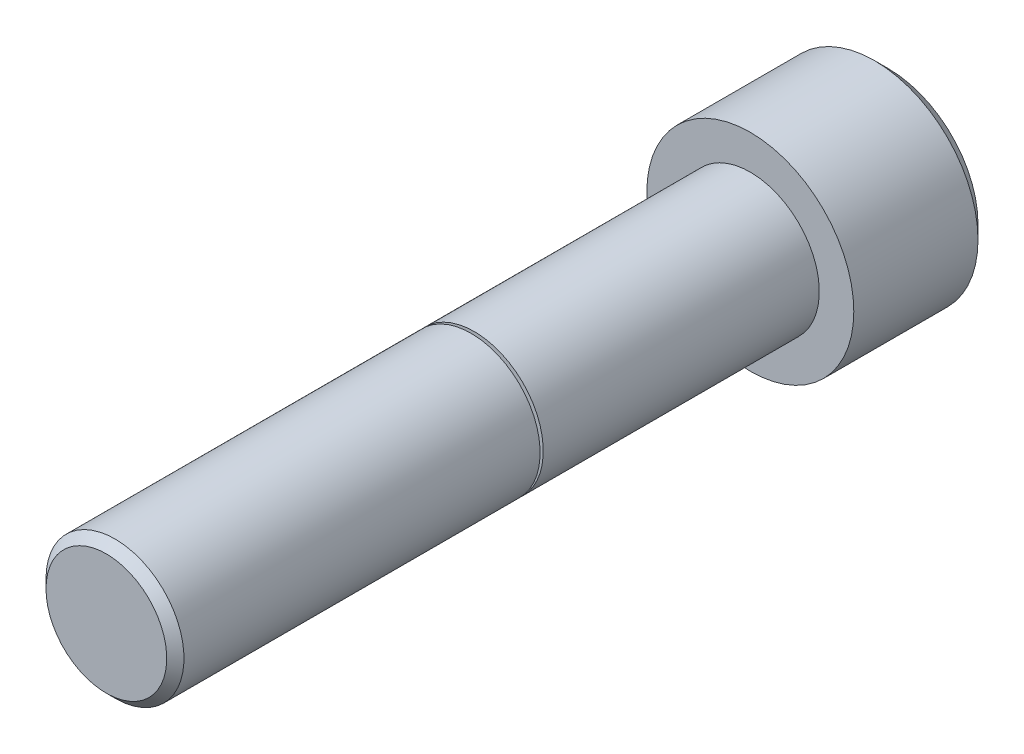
ISO-10303-21;
HEADER;
FILE_DESCRIPTION(('STEP AP214'),'2;1');
FILE_NAME('part.step','',(''),(''),'','','');
FILE_SCHEMA(('AUTOMOTIVE_DESIGN { 1 0 10303 214 1 1 1 1 }'));
ENDSEC;
DATA;
#1=APPLICATION_CONTEXT('core data for automotive mechanical design processes');
#2=APPLICATION_PROTOCOL_DEFINITION('international standard','automotive_design',2000,#1);
#3=PRODUCT_CONTEXT('',#1,'mechanical');
#4=PRODUCT('Part','Part','',(#3));
#5=PRODUCT_RELATED_PRODUCT_CATEGORY('part','',(#4));
#6=PRODUCT_DEFINITION_FORMATION('','',#4);
#7=PRODUCT_DEFINITION_CONTEXT('part definition',#1,'design');
#8=PRODUCT_DEFINITION('design','',#6,#7);
#9=PRODUCT_DEFINITION_SHAPE('','',#8);
#10=(LENGTH_UNIT() NAMED_UNIT(*) SI_UNIT(.MILLI.,.METRE.));
#11=(NAMED_UNIT(*) PLANE_ANGLE_UNIT() SI_UNIT($,.RADIAN.));
#12=(NAMED_UNIT(*) SI_UNIT($,.STERADIAN.) SOLID_ANGLE_UNIT());
#13=UNCERTAINTY_MEASURE_WITH_UNIT(LENGTH_MEASURE(1.E-05),#10,'distance_accuracy_value','');
#14=(GEOMETRIC_REPRESENTATION_CONTEXT(3) GLOBAL_UNCERTAINTY_ASSIGNED_CONTEXT((#13)) GLOBAL_UNIT_ASSIGNED_CONTEXT((#10,
#11,#12)) REPRESENTATION_CONTEXT('',''));
#15=CARTESIAN_POINT('',(0.,0.,0.));
#16=DIRECTION('',(0.,0.,1.));
#17=DIRECTION('',(1.,0.,0.));
#18=AXIS2_PLACEMENT_3D('',#15,#16,#17);
#19=CARTESIAN_POINT('',(0.,0.,-19.05));
#20=DIRECTION('',(0.,0.,1.));
#21=DIRECTION('',(1.,0.,0.));
#22=AXIS2_PLACEMENT_3D('',#19,#20,#21);
#23=PLANE('',#22);
#24=DIRECTION('',(-0.5,-0.866025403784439,0.));
#25=VECTOR('',#24,1.);
#26=CARTESIAN_POINT('',(9.16543552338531,0.,-19.05));
#27=LINE('',#26,#25);
#28=CARTESIAN_POINT('',(9.16543552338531,0.,-19.05));
#29=VERTEX_POINT('',#28);
#30=CARTESIAN_POINT('',(4.58271776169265,-7.9375,-19.05));
#31=VERTEX_POINT('',#30);
#32=EDGE_CURVE('E147',#29,#31,#27,.T.);
#33=ORIENTED_EDGE('',*,*,#32,.F.);
#34=DIRECTION('',(0.5,-0.866025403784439,0.));
#35=VECTOR('',#34,1.);
#36=CARTESIAN_POINT('',(4.58271776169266,7.9375,-19.05));
#37=LINE('',#36,#35);
#38=CARTESIAN_POINT('',(4.58271776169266,7.9375,-19.05));
#39=VERTEX_POINT('',#38);
#40=EDGE_CURVE('E66',#39,#29,#37,.T.);
#41=ORIENTED_EDGE('',*,*,#40,.F.);
#42=DIRECTION('',(1.,0.,0.));
#43=VECTOR('',#42,1.);
#44=CARTESIAN_POINT('',(-4.58271776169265,7.9375,-19.05));
#45=LINE('',#44,#43);
#46=CARTESIAN_POINT('',(-4.58271776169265,7.9375,-19.05));
#47=VERTEX_POINT('',#46);
#48=EDGE_CURVE('E160',#47,#39,#45,.T.);
#49=ORIENTED_EDGE('',*,*,#48,.F.);
#50=DIRECTION('',(0.5,0.866025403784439,0.));
#51=VECTOR('',#50,1.);
#52=CARTESIAN_POINT('',(-9.16543552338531,0.,-19.05));
#53=LINE('',#52,#51);
#54=CARTESIAN_POINT('',(-9.16543552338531,0.,-19.05));
#55=VERTEX_POINT('',#54);
#56=EDGE_CURVE('E157',#55,#47,#53,.T.);
#57=ORIENTED_EDGE('',*,*,#56,.F.);
#58=DIRECTION('',(-0.5,0.866025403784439,0.));
#59=VECTOR('',#58,1.);
#60=CARTESIAN_POINT('',(-4.58271776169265,-7.9375,-19.05));
#61=LINE('',#60,#59);
#62=CARTESIAN_POINT('',(-4.58271776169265,-7.9375,-19.05));
#63=VERTEX_POINT('',#62);
#64=EDGE_CURVE('E114',#63,#55,#61,.T.);
#65=ORIENTED_EDGE('',*,*,#64,.F.);
#66=DIRECTION('',(-1.,0.,0.));
#67=VECTOR('',#66,1.);
#68=CARTESIAN_POINT('',(4.58271776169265,-7.9375,-19.05));
#69=LINE('',#68,#67);
#70=EDGE_CURVE('E151',#31,#63,#69,.T.);
#71=ORIENTED_EDGE('',*,*,#70,.F.);
#72=EDGE_LOOP('',(#33,#41,#49,#57,#65,#71));
#73=FACE_BOUND('',#72,.T.);
#74=CARTESIAN_POINT('',(0.,0.,-19.05));
#75=DIRECTION('',(0.,0.,-1.));
#76=DIRECTION('',(-1.,0.,0.));
#77=AXIS2_PLACEMENT_3D('',#74,#75,#76);
#78=CIRCLE('',#77,12.3825);
#79=CARTESIAN_POINT('',(-12.3825,0.,-19.05));
#80=VERTEX_POINT('',#79);
#81=EDGE_CURVE('E166',#80,#80,#78,.T.);
#82=ORIENTED_EDGE('',*,*,#81,.T.);
#83=EDGE_LOOP('',(#82));
#84=FACE_BOUND('',#83,.T.);
#85=ADVANCED_FACE('F51',(#73,#84),#23,.F.);
#86=CARTESIAN_POINT('',(-8.33374000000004,0.,88.9));
#87=DIRECTION('',(0.,0.,-1.));
#88=DIRECTION('',(-1.,0.,0.));
#89=AXIS2_PLACEMENT_3D('',#86,#87,#88);
#90=PLANE('',#89);
#91=CARTESIAN_POINT('',(0.,0.,88.9));
#92=DIRECTION('',(0.,0.,-1.));
#93=DIRECTION('',(-1.,0.,0.));
#94=AXIS2_PLACEMENT_3D('',#91,#92,#93);
#95=CIRCLE('',#94,8.33374000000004);
#96=CARTESIAN_POINT('',(-8.33374000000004,0.,88.9));
#97=VERTEX_POINT('',#96);
#98=EDGE_CURVE('E11',#97,#97,#95,.T.);
#99=ORIENTED_EDGE('',*,*,#98,.F.);
#100=EDGE_LOOP('',(#99));
#101=FACE_BOUND('',#100,.T.);
#102=ADVANCED_FACE('F216',(#101),#90,.F.);
#103=CARTESIAN_POINT('',(0.,0.,88.9));
#104=DIRECTION('',(0.,0.,-1.));
#105=DIRECTION('',(-1.,0.,0.));
#106=AXIS2_PLACEMENT_3D('',#103,#104,#105);
#107=CONICAL_SURFACE('',#106,8.33374000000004,0.785398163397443);
#108=CARTESIAN_POINT('',(0.,0.,87.70874));
#109=DIRECTION('',(0.,0.,-1.));
#110=DIRECTION('',(-1.,0.,0.));
#111=AXIS2_PLACEMENT_3D('',#108,#109,#110);
#112=CIRCLE('',#111,9.52500000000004);
#113=CARTESIAN_POINT('',(-9.52500000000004,0.,87.70874));
#114=VERTEX_POINT('',#113);
#115=EDGE_CURVE('E59',#114,#114,#112,.T.);
#116=ORIENTED_EDGE('',*,*,#115,.F.);
#117=EDGE_LOOP('',(#116));
#118=FACE_BOUND('',#117,.T.);
#119=ORIENTED_EDGE('',*,*,#98,.T.);
#120=EDGE_LOOP('',(#119));
#121=FACE_BOUND('',#120,.T.);
#122=ADVANCED_FACE('F213',(#118,#121),#107,.T.);
#123=CARTESIAN_POINT('',(0.,0.,-10.585154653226));
#124=DIRECTION('',(0.,0.,-1.));
#125=DIRECTION('',(-1.,0.,0.));
#126=AXIS2_PLACEMENT_3D('',#123,#124,#125);
#127=CYLINDRICAL_SURFACE('',#126,9.52500000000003);
#128=CARTESIAN_POINT('',(0.,0.,38.5435831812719));
#129=DIRECTION('',(0.,0.,-1.));
#130=DIRECTION('',(-1.,0.,0.));
#131=AXIS2_PLACEMENT_3D('',#128,#129,#130);
#132=CIRCLE('',#131,9.52500000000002);
#133=CARTESIAN_POINT('',(-9.52500000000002,0.,38.5435831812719));
#134=VERTEX_POINT('',#133);
#135=EDGE_CURVE('E203',#134,#134,#132,.T.);
#136=ORIENTED_EDGE('',*,*,#135,.F.);
#137=EDGE_LOOP('',(#136));
#138=FACE_BOUND('',#137,.T.);
#139=ORIENTED_EDGE('',*,*,#115,.T.);
#140=EDGE_LOOP('',(#139));
#141=FACE_BOUND('',#140,.T.);
#142=ADVANCED_FACE('F211',(#138,#141),#127,.T.);
#143=CARTESIAN_POINT('',(0.,0.,38.5435831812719));
#144=DIRECTION('',(0.,0.,1.));
#145=DIRECTION('',(1.,0.,0.));
#146=AXIS2_PLACEMENT_3D('',#143,#144,#145);
#147=CONICAL_SURFACE('',#146,9.52500000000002,1.22173047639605);
#148=CARTESIAN_POINT('',(0.,0.,38.1487938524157));
#149=DIRECTION('',(0.,0.,-1.));
#150=DIRECTION('',(-1.,0.,0.));
#151=AXIS2_PLACEMENT_3D('',#148,#149,#150);
#152=CIRCLE('',#151,8.44032523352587);
#153=CARTESIAN_POINT('',(-8.44032523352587,0.,38.1487938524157));
#154=VERTEX_POINT('',#153);
#155=EDGE_CURVE('E199',#154,#154,#152,.T.);
#156=ORIENTED_EDGE('',*,*,#155,.F.);
#157=EDGE_LOOP('',(#156));
#158=FACE_BOUND('',#157,.T.);
#159=ORIENTED_EDGE('',*,*,#135,.T.);
#160=EDGE_LOOP('',(#159));
#161=FACE_BOUND('',#160,.T.);
#162=ADVANCED_FACE('F228',(#158,#161),#147,.T.);
#163=CARTESIAN_POINT('',(0.,0.,38.13));
#164=DIRECTION('',(0.,0.,-1.));
#165=DIRECTION('',(-1.,0.,0.));
#166=AXIS2_PLACEMENT_3D('',#163,#164,#165);
#167=TOROIDAL_SURFACE('',#166,8.44716563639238,0.0200000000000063);
#168=CARTESIAN_POINT('',(0.,0.,38.11));
#169=DIRECTION('',(0.,0.,-1.));
#170=DIRECTION('',(-1.,0.,0.));
#171=AXIS2_PLACEMENT_3D('',#168,#169,#170);
#172=CIRCLE('',#171,8.44716563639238);
#173=CARTESIAN_POINT('',(-8.44716563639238,0.,38.11));
#174=VERTEX_POINT('',#173);
#175=EDGE_CURVE('E195',#174,#174,#172,.T.);
#176=ORIENTED_EDGE('',*,*,#175,.F.);
#177=EDGE_LOOP('',(#176));
#178=FACE_BOUND('',#177,.T.);
#179=ORIENTED_EDGE('',*,*,#155,.T.);
#180=EDGE_LOOP('',(#179));
#181=FACE_BOUND('',#180,.T.);
#182=ADVANCED_FACE('F232',(#178,#181),#167,.F.);
#183=CARTESIAN_POINT('',(-9.52500000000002,0.,38.11));
#184=DIRECTION('',(0.,0.,-1.));
#185=DIRECTION('',(-1.,0.,0.));
#186=AXIS2_PLACEMENT_3D('',#183,#184,#185);
#187=PLANE('',#186);
#188=CARTESIAN_POINT('',(0.,0.,38.11));
#189=DIRECTION('',(0.,0.,-1.));
#190=DIRECTION('',(-1.,0.,0.));
#191=AXIS2_PLACEMENT_3D('',#188,#189,#190);
#192=CIRCLE('',#191,9.52500000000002);
#193=CARTESIAN_POINT('',(-9.52500000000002,0.,38.11));
#194=VERTEX_POINT('',#193);
#195=EDGE_CURVE('E191',#194,#194,#192,.T.);
#196=ORIENTED_EDGE('',*,*,#195,.F.);
#197=EDGE_LOOP('',(#196));
#198=FACE_BOUND('',#197,.T.);
#199=ORIENTED_EDGE('',*,*,#175,.T.);
#200=EDGE_LOOP('',(#199));
#201=FACE_BOUND('',#200,.T.);
#202=ADVANCED_FACE('F236',(#198,#201),#187,.F.);
#203=CARTESIAN_POINT('',(0.,0.,-10.585154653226));
#204=DIRECTION('',(0.,0.,-1.));
#205=DIRECTION('',(-1.,0.,0.));
#206=AXIS2_PLACEMENT_3D('',#203,#204,#205);
#207=CYLINDRICAL_SURFACE('',#206,9.52500000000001);
#208=CARTESIAN_POINT('',(0.,0.,0.));
#209=DIRECTION('',(0.,0.,-1.));
#210=DIRECTION('',(-1.,0.,0.));
#211=AXIS2_PLACEMENT_3D('',#208,#209,#210);
#212=CIRCLE('',#211,9.525);
#213=CARTESIAN_POINT('',(-9.525,0.,0.));
#214=VERTEX_POINT('',#213);
#215=EDGE_CURVE('E187',#214,#214,#212,.T.);
#216=ORIENTED_EDGE('',*,*,#215,.F.);
#217=EDGE_LOOP('',(#216));
#218=FACE_BOUND('',#217,.T.);
#219=ORIENTED_EDGE('',*,*,#195,.T.);
#220=EDGE_LOOP('',(#219));
#221=FACE_BOUND('',#220,.T.);
#222=ADVANCED_FACE('F240',(#218,#221),#207,.T.);
#223=CARTESIAN_POINT('',(-14.2875,0.,0.));
#224=DIRECTION('',(0.,0.,-1.));
#225=DIRECTION('',(-1.,0.,0.));
#226=AXIS2_PLACEMENT_3D('',#223,#224,#225);
#227=PLANE('',#226);
#228=CARTESIAN_POINT('',(0.,0.,0.));
#229=DIRECTION('',(0.,0.,-1.));
#230=DIRECTION('',(-1.,0.,0.));
#231=AXIS2_PLACEMENT_3D('',#228,#229,#230);
#232=CIRCLE('',#231,14.2875);
#233=CARTESIAN_POINT('',(-14.2875,0.,0.));
#234=VERTEX_POINT('',#233);
#235=EDGE_CURVE('E183',#234,#234,#232,.T.);
#236=ORIENTED_EDGE('',*,*,#235,.F.);
#237=EDGE_LOOP('',(#236));
#238=FACE_BOUND('',#237,.T.);
#239=ORIENTED_EDGE('',*,*,#215,.T.);
#240=EDGE_LOOP('',(#239));
#241=FACE_BOUND('',#240,.T.);
#242=ADVANCED_FACE('F244',(#238,#241),#227,.F.);
#243=CARTESIAN_POINT('',(0.,0.,-10.585154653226));
#244=DIRECTION('',(0.,0.,-1.));
#245=DIRECTION('',(-1.,0.,0.));
#246=AXIS2_PLACEMENT_3D('',#243,#244,#245);
#247=CYLINDRICAL_SURFACE('',#246,14.2875);
#248=CARTESIAN_POINT('',(0.,0.,-17.145));
#249=DIRECTION('',(0.,0.,-1.));
#250=DIRECTION('',(-1.,0.,0.));
#251=AXIS2_PLACEMENT_3D('',#248,#249,#250);
#252=CIRCLE('',#251,14.2875);
#253=CARTESIAN_POINT('',(-14.2875,0.,-17.145));
#254=VERTEX_POINT('',#253);
#255=EDGE_CURVE('E179',#254,#254,#252,.T.);
#256=ORIENTED_EDGE('',*,*,#255,.F.);
#257=EDGE_LOOP('',(#256));
#258=FACE_BOUND('',#257,.T.);
#259=ORIENTED_EDGE('',*,*,#235,.T.);
#260=EDGE_LOOP('',(#259));
#261=FACE_BOUND('',#260,.T.);
#262=ADVANCED_FACE('F248',(#258,#261),#247,.T.);
#263=CARTESIAN_POINT('',(0.,0.,-17.145));
#264=DIRECTION('',(0.,0.,1.));
#265=DIRECTION('',(1.,0.,0.));
#266=AXIS2_PLACEMENT_3D('',#263,#264,#265);
#267=CONICAL_SURFACE('',#266,14.2875,0.785398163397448);
#268=ORIENTED_EDGE('',*,*,#81,.F.);
#269=EDGE_LOOP('',(#268));
#270=FACE_BOUND('',#269,.T.);
#271=ORIENTED_EDGE('',*,*,#255,.T.);
#272=EDGE_LOOP('',(#271));
#273=FACE_BOUND('',#272,.T.);
#274=ADVANCED_FACE('F252',(#270,#273),#267,.T.);
#275=CARTESIAN_POINT('',(4.58271776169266,7.9375,-9.525));
#276=DIRECTION('',(0.866025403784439,0.5,0.));
#277=DIRECTION('',(-0.5,0.866025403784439,0.));
#278=AXIS2_PLACEMENT_3D('',#275,#276,#277);
#279=PLANE('',#278);
#280=ORIENTED_EDGE('',*,*,#40,.T.);
#281=DIRECTION('',(0.,0.,-1.));
#282=VECTOR('',#281,1.);
#283=CARTESIAN_POINT('',(9.16543552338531,0.,-9.525));
#284=LINE('',#283,#282);
#285=CARTESIAN_POINT('',(9.16543552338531,0.,-9.525));
#286=VERTEX_POINT('',#285);
#287=EDGE_CURVE('E96',#286,#29,#284,.T.);
#288=ORIENTED_EDGE('',*,*,#287,.F.);
#289=DIRECTION('',(0.5,-0.866025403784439,0.));
#290=VECTOR('',#289,1.);
#291=CARTESIAN_POINT('',(4.58271776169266,7.9375,-9.525));
#292=LINE('',#291,#290);
#293=CARTESIAN_POINT('',(4.58271776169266,7.9375,-9.525));
#294=VERTEX_POINT('',#293);
#295=EDGE_CURVE('E163',#294,#286,#292,.T.);
#296=ORIENTED_EDGE('',*,*,#295,.F.);
#297=DIRECTION('',(0.,0.,-1.));
#298=VECTOR('',#297,1.);
#299=CARTESIAN_POINT('',(4.58271776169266,7.9375,-9.525));
#300=LINE('',#299,#298);
#301=EDGE_CURVE('E74',#294,#39,#300,.T.);
#302=ORIENTED_EDGE('',*,*,#301,.T.);
#303=EDGE_LOOP('',(#280,#288,#296,#302));
#304=FACE_BOUND('',#303,.T.);
#305=ADVANCED_FACE('F256',(#304),#279,.F.);
#306=CARTESIAN_POINT('',(-4.58271776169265,7.9375,-9.525));
#307=DIRECTION('',(0.,1.,0.));
#308=DIRECTION('',(-1.,0.,0.));
#309=AXIS2_PLACEMENT_3D('',#306,#307,#308);
#310=PLANE('',#309);
#311=ORIENTED_EDGE('',*,*,#48,.T.);
#312=ORIENTED_EDGE('',*,*,#301,.F.);
#313=DIRECTION('',(1.,0.,0.));
#314=VECTOR('',#313,1.);
#315=CARTESIAN_POINT('',(-4.58271776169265,7.9375,-9.525));
#316=LINE('',#315,#314);
#317=CARTESIAN_POINT('',(-4.58271776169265,7.9375,-9.525));
#318=VERTEX_POINT('',#317);
#319=EDGE_CURVE('E128',#318,#294,#316,.T.);
#320=ORIENTED_EDGE('',*,*,#319,.F.);
#321=DIRECTION('',(0.,0.,-1.));
#322=VECTOR('',#321,1.);
#323=CARTESIAN_POINT('',(-4.58271776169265,7.9375,-9.525));
#324=LINE('',#323,#322);
#325=EDGE_CURVE('E119',#318,#47,#324,.T.);
#326=ORIENTED_EDGE('',*,*,#325,.T.);
#327=EDGE_LOOP('',(#311,#312,#320,#326));
#328=FACE_BOUND('',#327,.T.);
#329=ADVANCED_FACE('F260',(#328),#310,.F.);
#330=CARTESIAN_POINT('',(-9.16543552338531,0.,-9.525));
#331=DIRECTION('',(-0.866025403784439,0.5,0.));
#332=DIRECTION('',(-0.5,-0.866025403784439,0.));
#333=AXIS2_PLACEMENT_3D('',#330,#331,#332);
#334=PLANE('',#333);
#335=ORIENTED_EDGE('',*,*,#56,.T.);
#336=ORIENTED_EDGE('',*,*,#325,.F.);
#337=DIRECTION('',(0.5,0.866025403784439,0.));
#338=VECTOR('',#337,1.);
#339=CARTESIAN_POINT('',(-9.16543552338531,0.,-9.525));
#340=LINE('',#339,#338);
#341=CARTESIAN_POINT('',(-9.16543552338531,0.,-9.525));
#342=VERTEX_POINT('',#341);
#343=EDGE_CURVE('E123',#342,#318,#340,.T.);
#344=ORIENTED_EDGE('',*,*,#343,.F.);
#345=DIRECTION('',(0.,0.,-1.));
#346=VECTOR('',#345,1.);
#347=CARTESIAN_POINT('',(-9.16543552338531,0.,-9.525));
#348=LINE('',#347,#346);
#349=EDGE_CURVE('E107',#342,#55,#348,.T.);
#350=ORIENTED_EDGE('',*,*,#349,.T.);
#351=EDGE_LOOP('',(#335,#336,#344,#350));
#352=FACE_BOUND('',#351,.T.);
#353=ADVANCED_FACE('F124',(#352),#334,.F.);
#354=CARTESIAN_POINT('',(-4.58271776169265,-7.9375,-9.525));
#355=DIRECTION('',(-0.866025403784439,-0.5,0.));
#356=DIRECTION('',(0.5,-0.866025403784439,0.));
#357=AXIS2_PLACEMENT_3D('',#354,#355,#356);
#358=PLANE('',#357);
#359=ORIENTED_EDGE('',*,*,#64,.T.);
#360=ORIENTED_EDGE('',*,*,#349,.F.);
#361=DIRECTION('',(-0.5,0.866025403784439,0.));
#362=VECTOR('',#361,1.);
#363=CARTESIAN_POINT('',(-4.58271776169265,-7.9375,-9.525));
#364=LINE('',#363,#362);
#365=CARTESIAN_POINT('',(-4.58271776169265,-7.9375,-9.525));
#366=VERTEX_POINT('',#365);
#367=EDGE_CURVE('E111',#366,#342,#364,.T.);
#368=ORIENTED_EDGE('',*,*,#367,.F.);
#369=DIRECTION('',(0.,0.,-1.));
#370=VECTOR('',#369,1.);
#371=CARTESIAN_POINT('',(-4.58271776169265,-7.9375,-9.525));
#372=LINE('',#371,#370);
#373=EDGE_CURVE('E120',#366,#63,#372,.T.);
#374=ORIENTED_EDGE('',*,*,#373,.T.);
#375=EDGE_LOOP('',(#359,#360,#368,#374));
#376=FACE_BOUND('',#375,.T.);
#377=ADVANCED_FACE('F109',(#376),#358,.F.);
#378=CARTESIAN_POINT('',(4.58271776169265,-7.9375,-9.525));
#379=DIRECTION('',(0.,-1.,0.));
#380=DIRECTION('',(0.,0.,-1.));
#381=AXIS2_PLACEMENT_3D('',#378,#379,#380);
#382=PLANE('',#381);
#383=ORIENTED_EDGE('',*,*,#70,.T.);
#384=ORIENTED_EDGE('',*,*,#373,.F.);
#385=DIRECTION('',(-1.,0.,0.));
#386=VECTOR('',#385,1.);
#387=CARTESIAN_POINT('',(4.58271776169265,-7.9375,-9.525));
#388=LINE('',#387,#386);
#389=CARTESIAN_POINT('',(4.58271776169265,-7.9375,-9.525));
#390=VERTEX_POINT('',#389);
#391=EDGE_CURVE('E134',#390,#366,#388,.T.);
#392=ORIENTED_EDGE('',*,*,#391,.F.);
#393=DIRECTION('',(0.,0.,-1.));
#394=VECTOR('',#393,1.);
#395=CARTESIAN_POINT('',(4.58271776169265,-7.9375,-9.525));
#396=LINE('',#395,#394);
#397=EDGE_CURVE('E171',#390,#31,#396,.T.);
#398=ORIENTED_EDGE('',*,*,#397,.T.);
#399=EDGE_LOOP('',(#383,#384,#392,#398));
#400=FACE_BOUND('',#399,.T.);
#401=ADVANCED_FACE('F264',(#400),#382,.F.);
#402=CARTESIAN_POINT('',(9.16543552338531,0.,-9.525));
#403=DIRECTION('',(0.866025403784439,-0.5,0.));
#404=DIRECTION('',(0.5,0.866025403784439,0.));
#405=AXIS2_PLACEMENT_3D('',#402,#403,#404);
#406=PLANE('',#405);
#407=ORIENTED_EDGE('',*,*,#32,.T.);
#408=ORIENTED_EDGE('',*,*,#397,.F.);
#409=DIRECTION('',(-0.5,-0.866025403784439,0.));
#410=VECTOR('',#409,1.);
#411=CARTESIAN_POINT('',(9.16543552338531,0.,-9.525));
#412=LINE('',#411,#410);
#413=EDGE_CURVE('E139',#286,#390,#412,.T.);
#414=ORIENTED_EDGE('',*,*,#413,.F.);
#415=ORIENTED_EDGE('',*,*,#287,.T.);
#416=EDGE_LOOP('',(#407,#408,#414,#415));
#417=FACE_BOUND('',#416,.T.);
#418=ADVANCED_FACE('F261',(#417),#406,.F.);
#419=CARTESIAN_POINT('',(4.58271776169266,7.9375,-9.525));
#420=DIRECTION('',(0.,0.,1.));
#421=DIRECTION('',(1.,0.,0.));
#422=AXIS2_PLACEMENT_3D('',#419,#420,#421);
#423=PLANE('',#422);
#424=ORIENTED_EDGE('',*,*,#295,.T.);
#425=ORIENTED_EDGE('',*,*,#413,.T.);
#426=ORIENTED_EDGE('',*,*,#391,.T.);
#427=ORIENTED_EDGE('',*,*,#367,.T.);
#428=ORIENTED_EDGE('',*,*,#343,.T.);
#429=ORIENTED_EDGE('',*,*,#319,.T.);
#430=EDGE_LOOP('',(#424,#425,#426,#427,#428,#429));
#431=FACE_BOUND('',#430,.T.);
#432=ADVANCED_FACE('F131',(#431),#423,.F.);
#433=CLOSED_SHELL('',(#85,#102,#122,#142,#162,#182,#202,#222,#242,#262,#274,#305,#329,#353,#377,
#401,#418,#432));
#434=MANIFOLD_SOLID_BREP('B2',#433);
#435=ADVANCED_BREP_SHAPE_REPRESENTATION('',(#18,#434),#14);
#436=SHAPE_DEFINITION_REPRESENTATION(#9,#435);
ENDSEC;
END-ISO-10303-21;
